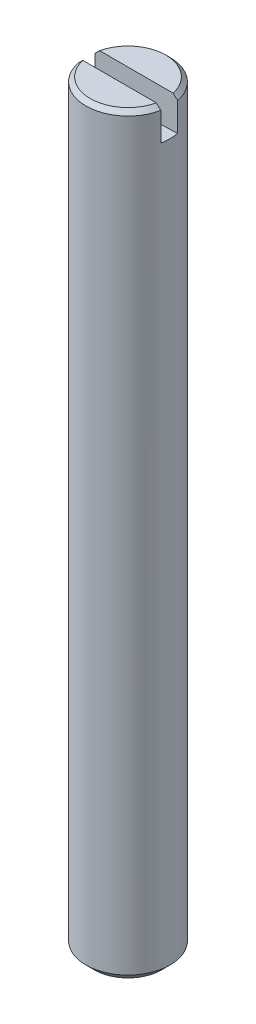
ISO-10303-21;
HEADER;
FILE_DESCRIPTION(('STEP AP214'),'2;1');
FILE_NAME('part.step','',(''),(''),'','','');
FILE_SCHEMA(('AUTOMOTIVE_DESIGN { 1 0 10303 214 1 1 1 1 }'));
ENDSEC;
DATA;
#1=APPLICATION_CONTEXT('core data for automotive mechanical design processes');
#2=APPLICATION_PROTOCOL_DEFINITION('international standard','automotive_design',2000,#1);
#3=PRODUCT_CONTEXT('',#1,'mechanical');
#4=PRODUCT('Part','Part','',(#3));
#5=PRODUCT_RELATED_PRODUCT_CATEGORY('part','',(#4));
#6=PRODUCT_DEFINITION_FORMATION('','',#4);
#7=PRODUCT_DEFINITION_CONTEXT('part definition',#1,'design');
#8=PRODUCT_DEFINITION('design','',#6,#7);
#9=PRODUCT_DEFINITION_SHAPE('','',#8);
#10=(LENGTH_UNIT() NAMED_UNIT(*) SI_UNIT(.MILLI.,.METRE.));
#11=(NAMED_UNIT(*) PLANE_ANGLE_UNIT() SI_UNIT($,.RADIAN.));
#12=(NAMED_UNIT(*) SI_UNIT($,.STERADIAN.) SOLID_ANGLE_UNIT());
#13=UNCERTAINTY_MEASURE_WITH_UNIT(LENGTH_MEASURE(1.E-05),#10,'distance_accuracy_value','');
#14=(GEOMETRIC_REPRESENTATION_CONTEXT(3) GLOBAL_UNCERTAINTY_ASSIGNED_CONTEXT((#13)) GLOBAL_UNIT_ASSIGNED_CONTEXT((#10,
#11,#12)) REPRESENTATION_CONTEXT('',''));
#15=CARTESIAN_POINT('',(0.,0.,0.));
#16=DIRECTION('',(0.,0.,1.));
#17=DIRECTION('',(1.,0.,0.));
#18=AXIS2_PLACEMENT_3D('',#15,#16,#17);
#19=CARTESIAN_POINT('',(0.,22.,0.));
#20=DIRECTION('',(0.,-1.,0.));
#21=DIRECTION('',(0.,0.,-1.));
#22=AXIS2_PLACEMENT_3D('',#19,#20,#21);
#23=PLANE('',#22);
#24=CARTESIAN_POINT('',(0.,21.9999999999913,0.));
#25=DIRECTION('',(0.,-1.,0.));
#26=DIRECTION('',(0.,0.,-1.));
#27=AXIS2_PLACEMENT_3D('',#24,#25,#26);
#28=CIRCLE('',#27,1.34650000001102);
#29=CARTESIAN_POINT('',(-1.31265465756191,21.9999999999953,-0.3));
#30=VERTEX_POINT('',#29);
#31=CARTESIAN_POINT('',(1.31265465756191,21.9999999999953,-0.3));
#32=VERTEX_POINT('',#31);
#33=EDGE_CURVE('E165',#30,#32,#28,.T.);
#34=ORIENTED_EDGE('',*,*,#33,.F.);
#35=DIRECTION('',(1.,0.,0.));
#36=VECTOR('',#35,1.);
#37=CARTESIAN_POINT('',(0.,22.,-0.3));
#38=LINE('',#37,#36);
#39=EDGE_CURVE('E163',#32,#30,#38,.F.);
#40=ORIENTED_EDGE('',*,*,#39,.F.);
#41=EDGE_LOOP('',(#34,#40));
#42=FACE_BOUND('',#41,.T.);
#43=ADVANCED_FACE('F14',(#42),#23,.F.);
#44=CARTESIAN_POINT('',(0.,22.,0.));
#45=DIRECTION('',(0.,-1.,0.));
#46=DIRECTION('',(0.,0.,-1.));
#47=AXIS2_PLACEMENT_3D('',#44,#45,#46);
#48=PLANE('',#47);
#49=DIRECTION('',(1.,0.,0.));
#50=VECTOR('',#49,1.);
#51=CARTESIAN_POINT('',(0.,22.,0.3));
#52=LINE('',#51,#50);
#53=CARTESIAN_POINT('',(-1.31265465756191,21.9999999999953,0.3));
#54=VERTEX_POINT('',#53);
#55=CARTESIAN_POINT('',(1.31265465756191,21.9999999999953,0.3));
#56=VERTEX_POINT('',#55);
#57=EDGE_CURVE('E161',#54,#56,#52,.T.);
#58=ORIENTED_EDGE('',*,*,#57,.F.);
#59=CARTESIAN_POINT('',(0.,21.9999999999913,0.));
#60=DIRECTION('',(0.,-1.,0.));
#61=DIRECTION('',(0.,0.,-1.));
#62=AXIS2_PLACEMENT_3D('',#59,#60,#61);
#63=CIRCLE('',#62,1.34650000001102);
#64=EDGE_CURVE('E159',#56,#54,#63,.T.);
#65=ORIENTED_EDGE('',*,*,#64,.F.);
#66=EDGE_LOOP('',(#58,#65));
#67=FACE_BOUND('',#66,.T.);
#68=ADVANCED_FACE('F121',(#67),#48,.F.);
#69=CARTESIAN_POINT('',(0.,21.846499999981,0.));
#70=DIRECTION('',(0.,-1.,0.));
#71=DIRECTION('',(0.,0.,-1.));
#72=AXIS2_PLACEMENT_3D('',#69,#70,#71);
#73=CONICAL_SURFACE('',#72,1.50000000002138,0.785398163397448);
#74=CARTESIAN_POINT('',(-1.31265465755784,21.9999999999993,-0.3));
#75=CARTESIAN_POINT('',(-1.33886002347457,21.9744495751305,-0.3));
#76=CARTESIAN_POINT('',(-1.36504930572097,21.9488826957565,-0.3));
#77=CARTESIAN_POINT('',(-1.41739570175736,21.8977160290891,-0.3));
#78=CARTESIAN_POINT('',(-1.44355281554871,21.872116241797,-0.3));
#79=CARTESIAN_POINT('',(-1.4696938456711,21.8465000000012,-0.3));
#80=B_SPLINE_CURVE_WITH_KNOTS('',3,(#74,#75,#76,#77,#78,#79),.UNSPECIFIED.,.F.,.F.,(4,2,4),(0.,
0.109799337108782,0.219598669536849),.UNSPECIFIED.);
#81=CARTESIAN_POINT('',(-1.46969384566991,21.8465000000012,-0.3));
#82=VERTEX_POINT('',#81);
#83=EDGE_CURVE('E39',#30,#82,#80,.T.);
#84=ORIENTED_EDGE('',*,*,#83,.F.);
#85=ORIENTED_EDGE('',*,*,#33,.T.);
#86=CARTESIAN_POINT('',(1.46969384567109,21.8465000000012,-0.3));
#87=CARTESIAN_POINT('',(1.4435528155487,21.872116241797,-0.3));
#88=CARTESIAN_POINT('',(1.41739570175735,21.8977160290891,-0.3));
#89=CARTESIAN_POINT('',(1.36504930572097,21.9488826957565,-0.3));
#90=CARTESIAN_POINT('',(1.33886002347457,21.9744495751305,-0.3));
#91=CARTESIAN_POINT('',(1.31265465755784,21.9999999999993,-0.3));
#92=B_SPLINE_CURVE_WITH_KNOTS('',3,(#86,#87,#88,#89,#90,#91),.UNSPECIFIED.,.F.,.F.,(4,2,4),(0.,
0.109799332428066,0.219598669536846),.UNSPECIFIED.);
#93=CARTESIAN_POINT('',(1.4696938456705,21.8465000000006,-0.3));
#94=VERTEX_POINT('',#93);
#95=EDGE_CURVE('E134',#94,#32,#92,.T.);
#96=ORIENTED_EDGE('',*,*,#95,.F.);
#97=CARTESIAN_POINT('',(0.,21.8465,0.));
#98=DIRECTION('',(0.,-1.,0.));
#99=DIRECTION('',(0.,0.,-1.));
#100=AXIS2_PLACEMENT_3D('',#97,#98,#99);
#101=CIRCLE('',#100,1.5);
#102=EDGE_CURVE('E9',#82,#94,#101,.T.);
#103=ORIENTED_EDGE('',*,*,#102,.F.);
#104=EDGE_LOOP('',(#84,#85,#96,#103));
#105=FACE_BOUND('',#104,.T.);
#106=ADVANCED_FACE('F116',(#105),#73,.T.);
#107=CARTESIAN_POINT('',(0.,52.3,-0.3));
#108=DIRECTION('',(0.,0.,1.));
#109=DIRECTION('',(1.,0.,0.));
#110=AXIS2_PLACEMENT_3D('',#107,#108,#109);
#111=PLANE('',#110);
#112=ORIENTED_EDGE('',*,*,#39,.T.);
#113=ORIENTED_EDGE('',*,*,#83,.T.);
#114=DIRECTION('',(0.,1.,0.));
#115=VECTOR('',#114,1.);
#116=CARTESIAN_POINT('',(-1.46969384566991,52.3,-0.3));
#117=LINE('',#116,#115);
#118=CARTESIAN_POINT('',(-1.46969384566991,20.8343043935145,-0.3));
#119=VERTEX_POINT('',#118);
#120=EDGE_CURVE('E154',#82,#119,#117,.F.);
#121=ORIENTED_EDGE('',*,*,#120,.T.);
#122=CARTESIAN_POINT('',(0.,52.3,-0.3));
#123=DIRECTION('',(0.,0.,-1.));
#124=DIRECTION('',(-1.,0.,0.));
#125=AXIS2_PLACEMENT_3D('',#122,#123,#124);
#126=CIRCLE('',#125,31.5);
#127=CARTESIAN_POINT('',(1.46969384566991,20.8343043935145,-0.3));
#128=VERTEX_POINT('',#127);
#129=EDGE_CURVE('E88',#119,#128,#126,.F.);
#130=ORIENTED_EDGE('',*,*,#129,.T.);
#131=DIRECTION('',(0.,1.,0.));
#132=VECTOR('',#131,1.);
#133=CARTESIAN_POINT('',(1.46969384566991,52.3,-0.3));
#134=LINE('',#133,#132);
#135=EDGE_CURVE('E140',#128,#94,#134,.T.);
#136=ORIENTED_EDGE('',*,*,#135,.T.);
#137=ORIENTED_EDGE('',*,*,#95,.T.);
#138=EDGE_LOOP('',(#112,#113,#121,#130,#136,#137));
#139=FACE_BOUND('',#138,.T.);
#140=ADVANCED_FACE('F120',(#139),#111,.T.);
#141=CARTESIAN_POINT('',(0.,21.846499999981,0.));
#142=DIRECTION('',(0.,-1.,0.));
#143=DIRECTION('',(0.,0.,-1.));
#144=AXIS2_PLACEMENT_3D('',#141,#142,#143);
#145=CONICAL_SURFACE('',#144,1.50000000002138,0.785398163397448);
#146=ORIENTED_EDGE('',*,*,#64,.T.);
#147=CARTESIAN_POINT('',(-1.31265465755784,21.9999999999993,0.3));
#148=CARTESIAN_POINT('',(-1.33886002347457,21.9744495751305,0.3));
#149=CARTESIAN_POINT('',(-1.36504930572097,21.9488826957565,0.3));
#150=CARTESIAN_POINT('',(-1.41739570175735,21.8977160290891,0.3));
#151=CARTESIAN_POINT('',(-1.4435528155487,21.872116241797,0.3));
#152=CARTESIAN_POINT('',(-1.46969384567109,21.8465000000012,0.3));
#153=B_SPLINE_CURVE_WITH_KNOTS('',3,(#147,#148,#149,#150,#151,#152),.UNSPECIFIED.,.F.,.F.,(4,2,
4),(0.,0.109799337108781,0.219598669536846),.UNSPECIFIED.);
#154=CARTESIAN_POINT('',(-1.4696938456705,21.8465000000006,0.3));
#155=VERTEX_POINT('',#154);
#156=EDGE_CURVE('E149',#54,#155,#153,.T.);
#157=ORIENTED_EDGE('',*,*,#156,.T.);
#158=CARTESIAN_POINT('',(0.,21.8465,0.));
#159=DIRECTION('',(0.,-1.,0.));
#160=DIRECTION('',(0.,0.,-1.));
#161=AXIS2_PLACEMENT_3D('',#158,#159,#160);
#162=CIRCLE('',#161,1.5);
#163=CARTESIAN_POINT('',(1.46969384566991,21.8465000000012,0.3));
#164=VERTEX_POINT('',#163);
#165=EDGE_CURVE('E30',#164,#155,#162,.T.);
#166=ORIENTED_EDGE('',*,*,#165,.F.);
#167=CARTESIAN_POINT('',(1.4696938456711,21.8465000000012,0.3));
#168=CARTESIAN_POINT('',(1.44355281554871,21.872116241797,0.3));
#169=CARTESIAN_POINT('',(1.41739570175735,21.8977160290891,0.3));
#170=CARTESIAN_POINT('',(1.36504930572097,21.9488826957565,0.3));
#171=CARTESIAN_POINT('',(1.33886002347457,21.9744495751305,0.3));
#172=CARTESIAN_POINT('',(1.31265465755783,21.9999999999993,0.3));
#173=B_SPLINE_CURVE_WITH_KNOTS('',3,(#167,#168,#169,#170,#171,#172),.UNSPECIFIED.,.F.,.F.,(4,2,
4),(0.,0.109799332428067,0.219598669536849),.UNSPECIFIED.);
#174=EDGE_CURVE('E96',#164,#56,#173,.T.);
#175=ORIENTED_EDGE('',*,*,#174,.T.);
#176=EDGE_LOOP('',(#146,#157,#166,#175));
#177=FACE_BOUND('',#176,.T.);
#178=ADVANCED_FACE('F122',(#177),#145,.T.);
#179=CARTESIAN_POINT('',(0.,52.3,0.3));
#180=DIRECTION('',(0.,0.,1.));
#181=DIRECTION('',(1.,0.,0.));
#182=AXIS2_PLACEMENT_3D('',#179,#180,#181);
#183=PLANE('',#182);
#184=ORIENTED_EDGE('',*,*,#57,.T.);
#185=ORIENTED_EDGE('',*,*,#174,.F.);
#186=DIRECTION('',(0.,1.,0.));
#187=VECTOR('',#186,1.);
#188=CARTESIAN_POINT('',(1.46969384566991,52.3,0.3));
#189=LINE('',#188,#187);
#190=CARTESIAN_POINT('',(1.46969384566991,20.8343043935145,0.3));
#191=VERTEX_POINT('',#190);
#192=EDGE_CURVE('E94',#191,#164,#189,.T.);
#193=ORIENTED_EDGE('',*,*,#192,.F.);
#194=CARTESIAN_POINT('',(0.,52.3,0.3));
#195=DIRECTION('',(0.,0.,-1.));
#196=DIRECTION('',(-1.,0.,0.));
#197=AXIS2_PLACEMENT_3D('',#194,#195,#196);
#198=CIRCLE('',#197,31.5);
#199=CARTESIAN_POINT('',(-1.46969384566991,20.8343043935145,0.3));
#200=VERTEX_POINT('',#199);
#201=EDGE_CURVE('E81',#200,#191,#198,.F.);
#202=ORIENTED_EDGE('',*,*,#201,.F.);
#203=DIRECTION('',(0.,1.,0.));
#204=VECTOR('',#203,1.);
#205=CARTESIAN_POINT('',(-1.46969384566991,52.3,0.3));
#206=LINE('',#205,#204);
#207=EDGE_CURVE('E73',#155,#200,#206,.F.);
#208=ORIENTED_EDGE('',*,*,#207,.F.);
#209=ORIENTED_EDGE('',*,*,#156,.F.);
#210=EDGE_LOOP('',(#184,#185,#193,#202,#208,#209));
#211=FACE_BOUND('',#210,.T.);
#212=ADVANCED_FACE('F92',(#211),#183,.F.);
#213=CARTESIAN_POINT('',(0.,52.3,0.3));
#214=DIRECTION('',(0.,0.,-1.));
#215=DIRECTION('',(-1.,0.,0.));
#216=AXIS2_PLACEMENT_3D('',#213,#214,#215);
#217=CYLINDRICAL_SURFACE('',#216,31.5);
#218=CARTESIAN_POINT('',(1.46969384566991,20.8343043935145,-0.3));
#219=CARTESIAN_POINT('',(1.47819327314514,20.8347020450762,-0.258385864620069));
#220=CARTESIAN_POINT('',(1.48491598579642,20.8350188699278,-0.216408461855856));
#221=CARTESIAN_POINT('',(1.49478157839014,20.8354856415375,-0.132020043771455));
#222=CARTESIAN_POINT('',(1.49792328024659,20.8356355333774,-0.0896088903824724));
#223=CARTESIAN_POINT('',(1.50057258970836,20.8357618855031,-0.00538043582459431));
#224=CARTESIAN_POINT('',(1.50013980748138,20.8357411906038,0.036435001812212));
#225=CARTESIAN_POINT('',(1.49578575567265,20.8355338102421,0.119866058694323));
#226=CARTESIAN_POINT('',(1.49186606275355,20.835347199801,0.161481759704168));
#227=CARTESIAN_POINT('',(1.48177716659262,20.8348708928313,0.235411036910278));
#228=CARTESIAN_POINT('',(1.47626595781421,20.8346116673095,0.267815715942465));
#229=CARTESIAN_POINT('',(1.46969384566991,20.8343043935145,0.3));
#230=B_SPLINE_CURVE_WITH_KNOTS('',3,(#218,#219,#220,#221,#222,#223,#224,#225,#226,#227,#228,
#229),.UNSPECIFIED.,.F.,.F.,(4,2,2,2,2,4),(0.,0.127386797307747,0.254815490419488,
0.380123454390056,0.505374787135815,0.603915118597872),.UNSPECIFIED.);
#231=EDGE_CURVE('E82',#128,#191,#230,.T.);
#232=ORIENTED_EDGE('',*,*,#231,.F.);
#233=ORIENTED_EDGE('',*,*,#129,.F.);
#234=CARTESIAN_POINT('',(-1.46969384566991,20.8343043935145,0.3));
#235=CARTESIAN_POINT('',(-1.47819327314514,20.8347020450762,0.258385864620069));
#236=CARTESIAN_POINT('',(-1.48491598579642,20.8350188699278,0.216408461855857));
#237=CARTESIAN_POINT('',(-1.49478157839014,20.8354856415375,0.132020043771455));
#238=CARTESIAN_POINT('',(-1.49792328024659,20.8356355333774,0.089608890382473));
#239=CARTESIAN_POINT('',(-1.50057258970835,20.8357618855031,0.00538043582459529));
#240=CARTESIAN_POINT('',(-1.50013980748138,20.8357411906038,-0.0364350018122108));
#241=CARTESIAN_POINT('',(-1.49578575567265,20.8355338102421,-0.119866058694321));
#242=CARTESIAN_POINT('',(-1.49186606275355,20.835347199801,-0.161481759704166));
#243=CARTESIAN_POINT('',(-1.48177716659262,20.8348708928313,-0.235411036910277));
#244=CARTESIAN_POINT('',(-1.47626595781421,20.8346116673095,-0.267815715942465));
#245=CARTESIAN_POINT('',(-1.46969384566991,20.8343043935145,-0.3));
#246=B_SPLINE_CURVE_WITH_KNOTS('',3,(#234,#235,#236,#237,#238,#239,#240,#241,#242,#243,#244,
#245),.UNSPECIFIED.,.F.,.F.,(4,2,2,2,2,4),(0.,0.127386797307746,0.254815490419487,
0.380123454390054,0.505374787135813,0.603915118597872),.UNSPECIFIED.);
#247=EDGE_CURVE('E19',#200,#119,#246,.T.);
#248=ORIENTED_EDGE('',*,*,#247,.F.);
#249=ORIENTED_EDGE('',*,*,#201,.T.);
#250=EDGE_LOOP('',(#232,#233,#248,#249));
#251=FACE_BOUND('',#250,.T.);
#252=ADVANCED_FACE('F16',(#251),#217,.F.);
#253=CARTESIAN_POINT('',(0.,15.,0.));
#254=DIRECTION('',(0.,-1.,0.));
#255=DIRECTION('',(0.,0.,-1.));
#256=AXIS2_PLACEMENT_3D('',#253,#254,#255);
#257=CYLINDRICAL_SURFACE('',#256,1.5);
#258=ORIENTED_EDGE('',*,*,#231,.T.);
#259=ORIENTED_EDGE('',*,*,#192,.T.);
#260=ORIENTED_EDGE('',*,*,#165,.T.);
#261=ORIENTED_EDGE('',*,*,#207,.T.);
#262=ORIENTED_EDGE('',*,*,#247,.T.);
#263=ORIENTED_EDGE('',*,*,#120,.F.);
#264=ORIENTED_EDGE('',*,*,#102,.T.);
#265=ORIENTED_EDGE('',*,*,#135,.F.);
#266=EDGE_LOOP('',(#258,#259,#260,#261,#262,#263,#264,#265));
#267=FACE_BOUND('',#266,.T.);
#268=CARTESIAN_POINT('',(0.,-4.6935,0.));
#269=DIRECTION('',(0.,-1.,0.));
#270=DIRECTION('',(0.,0.,-1.));
#271=AXIS2_PLACEMENT_3D('',#268,#269,#270);
#272=CIRCLE('',#271,1.5);
#273=CARTESIAN_POINT('',(0.,-4.6935,-1.5));
#274=VERTEX_POINT('',#273);
#275=EDGE_CURVE('E172',#274,#274,#272,.F.);
#276=ORIENTED_EDGE('',*,*,#275,.T.);
#277=EDGE_LOOP('',(#276));
#278=FACE_BOUND('',#277,.T.);
#279=ADVANCED_FACE('F75',(#267,#278),#257,.T.);
#280=CARTESIAN_POINT('',(1.1935,-5.,0.));
#281=DIRECTION('',(0.,1.,0.));
#282=DIRECTION('',(0.,0.,1.));
#283=AXIS2_PLACEMENT_3D('',#280,#281,#282);
#284=PLANE('',#283);
#285=CARTESIAN_POINT('',(0.,-5.,0.));
#286=DIRECTION('',(0.,1.,0.));
#287=DIRECTION('',(0.,0.,1.));
#288=AXIS2_PLACEMENT_3D('',#285,#286,#287);
#289=CIRCLE('',#288,1.19350000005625);
#290=CARTESIAN_POINT('',(0.,-5.,1.19350000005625));
#291=VERTEX_POINT('',#290);
#292=EDGE_CURVE('E90',#291,#291,#289,.T.);
#293=ORIENTED_EDGE('',*,*,#292,.F.);
#294=EDGE_LOOP('',(#293));
#295=FACE_BOUND('',#294,.T.);
#296=ADVANCED_FACE('F113',(#295),#284,.F.);
#297=CARTESIAN_POINT('',(0.,-4.69350000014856,0.));
#298=DIRECTION('',(0.,1.,0.));
#299=DIRECTION('',(0.,0.,1.));
#300=AXIS2_PLACEMENT_3D('',#297,#298,#299);
#301=CONICAL_SURFACE('',#300,1.49999999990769,0.785398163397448);
#302=ORIENTED_EDGE('',*,*,#275,.F.);
#303=EDGE_LOOP('',(#302));
#304=FACE_BOUND('',#303,.T.);
#305=ORIENTED_EDGE('',*,*,#292,.T.);
#306=EDGE_LOOP('',(#305));
#307=FACE_BOUND('',#306,.T.);
#308=ADVANCED_FACE('F114',(#304,#307),#301,.T.);
#309=CLOSED_SHELL('',(#43,#68,#106,#140,#178,#212,#252,#279,#296,#308));
#310=MANIFOLD_SOLID_BREP('B1',#309);
#311=ADVANCED_BREP_SHAPE_REPRESENTATION('',(#18,#310),#14);
#312=SHAPE_DEFINITION_REPRESENTATION(#9,#311);
ENDSEC;
END-ISO-10303-21;
